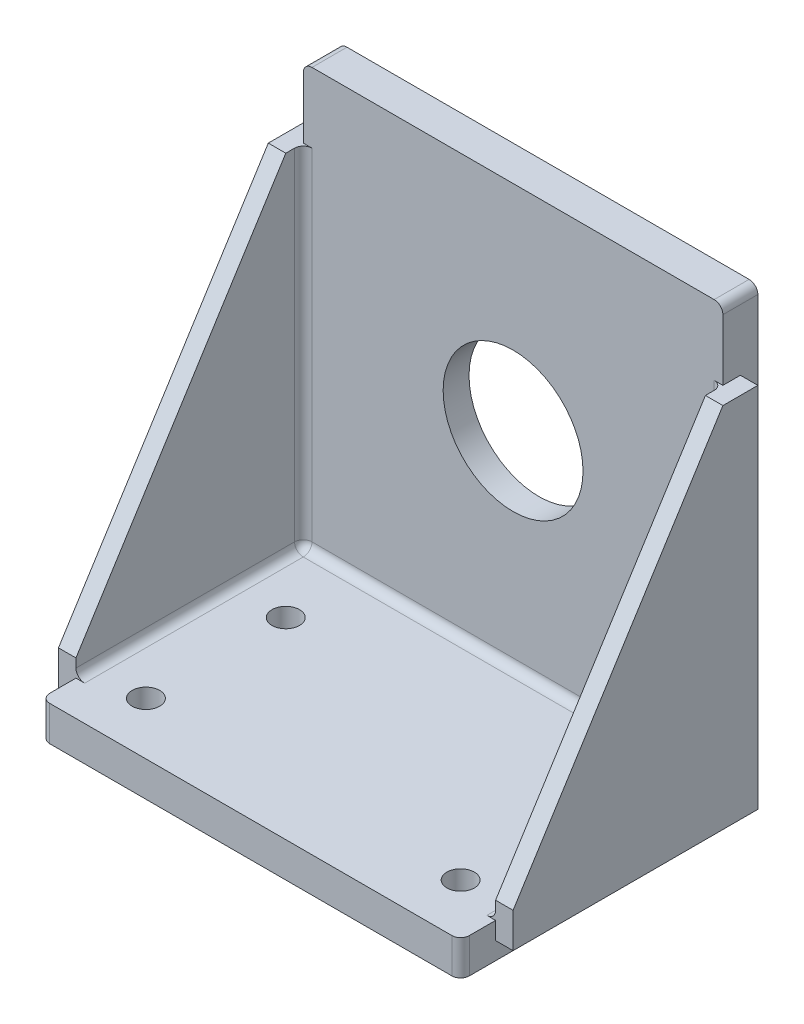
ISO-10303-21;
HEADER;
FILE_DESCRIPTION(('STEP AP214'),'2;1');
FILE_NAME('part.step','',(''),(''),'','','');
FILE_SCHEMA(('AUTOMOTIVE_DESIGN { 1 0 10303 214 1 1 1 1 }'));
ENDSEC;
DATA;
#1=APPLICATION_CONTEXT('core data for automotive mechanical design processes');
#2=APPLICATION_PROTOCOL_DEFINITION('international standard','automotive_design',2000,#1);
#3=PRODUCT_CONTEXT('',#1,'mechanical');
#4=PRODUCT('Part','Part','',(#3));
#5=PRODUCT_RELATED_PRODUCT_CATEGORY('part','',(#4));
#6=PRODUCT_DEFINITION_FORMATION('','',#4);
#7=PRODUCT_DEFINITION_CONTEXT('part definition',#1,'design');
#8=PRODUCT_DEFINITION('design','',#6,#7);
#9=PRODUCT_DEFINITION_SHAPE('','',#8);
#10=(LENGTH_UNIT() NAMED_UNIT(*) SI_UNIT(.MILLI.,.METRE.));
#11=(NAMED_UNIT(*) PLANE_ANGLE_UNIT() SI_UNIT($,.RADIAN.));
#12=(NAMED_UNIT(*) SI_UNIT($,.STERADIAN.) SOLID_ANGLE_UNIT());
#13=UNCERTAINTY_MEASURE_WITH_UNIT(LENGTH_MEASURE(1.E-05),#10,'distance_accuracy_value','');
#14=(GEOMETRIC_REPRESENTATION_CONTEXT(3) GLOBAL_UNCERTAINTY_ASSIGNED_CONTEXT((#13)) GLOBAL_UNIT_ASSIGNED_CONTEXT((#10,
#11,#12)) REPRESENTATION_CONTEXT('',''));
#15=CARTESIAN_POINT('',(0.,0.,0.));
#16=DIRECTION('',(0.,0.,1.));
#17=DIRECTION('',(1.,0.,0.));
#18=AXIS2_PLACEMENT_3D('',#15,#16,#17);
#19=CARTESIAN_POINT('',(-76.2,77.7875,12.7));
#20=DIRECTION('',(1.,0.,0.));
#21=DIRECTION('',(0.,1.,0.));
#22=AXIS2_PLACEMENT_3D('',#19,#20,#21);
#23=PLANE('',#22);
#24=DIRECTION('',(0.,0.,-1.));
#25=VECTOR('',#24,1.);
#26=CARTESIAN_POINT('',(-76.2,-87.3125,107.95));
#27=LINE('',#26,#25);
#28=CARTESIAN_POINT('',(-76.2,-87.3125,104.775));
#29=VERTEX_POINT('',#28);
#30=CARTESIAN_POINT('',(-76.2,-87.3125,6.35));
#31=VERTEX_POINT('',#30);
#32=EDGE_CURVE('E340',#29,#31,#27,.T.);
#33=ORIENTED_EDGE('',*,*,#32,.F.);
#34=DIRECTION('',(0.,1.,0.));
#35=VECTOR('',#34,1.);
#36=CARTESIAN_POINT('',(-76.2,77.7875,104.775));
#37=LINE('',#36,#35);
#38=CARTESIAN_POINT('',(-76.2,-74.6125,104.775));
#39=VERTEX_POINT('',#38);
#40=EDGE_CURVE('E467',#29,#39,#37,.T.);
#41=ORIENTED_EDGE('',*,*,#40,.T.);
#42=DIRECTION('',(0.,0.,1.));
#43=VECTOR('',#42,1.);
#44=CARTESIAN_POINT('',(-76.2,-74.6125,6.35));
#45=LINE('',#44,#43);
#46=CARTESIAN_POINT('',(-76.2,-74.6125,95.25));
#47=VERTEX_POINT('',#46);
#48=EDGE_CURVE('E343',#47,#39,#45,.T.);
#49=ORIENTED_EDGE('',*,*,#48,.F.);
#50=DIRECTION('',(0.,-1.,0.));
#51=VECTOR('',#50,1.);
#52=CARTESIAN_POINT('',(-76.2,-68.2625,95.25));
#53=LINE('',#52,#51);
#54=CARTESIAN_POINT('',(-76.2,-80.9625,95.25));
#55=VERTEX_POINT('',#54);
#56=EDGE_CURVE('E281',#47,#55,#53,.T.);
#57=ORIENTED_EDGE('',*,*,#56,.T.);
#58=DIRECTION('',(0.,0.,1.));
#59=VECTOR('',#58,1.);
#60=CARTESIAN_POINT('',(-76.2,-80.9625,6.35));
#61=LINE('',#60,#59);
#62=CARTESIAN_POINT('',(-76.2,-80.9625,6.35));
#63=VERTEX_POINT('',#62);
#64=EDGE_CURVE('E277',#63,#55,#61,.T.);
#65=ORIENTED_EDGE('',*,*,#64,.F.);
#66=DIRECTION('',(0.,-1.,0.));
#67=VECTOR('',#66,1.);
#68=CARTESIAN_POINT('',(-76.2,-74.6125,6.35));
#69=LINE('',#68,#67);
#70=EDGE_CURVE('E337',#63,#31,#69,.T.);
#71=ORIENTED_EDGE('',*,*,#70,.T.);
#72=EDGE_LOOP('',(#33,#41,#49,#57,#65,#71));
#73=FACE_BOUND('',#72,.T.);
#74=ADVANCED_FACE('F41',(#73),#23,.F.);
#75=CARTESIAN_POINT('',(76.2,-74.6125,12.7));
#76=DIRECTION('',(-1.,0.,0.));
#77=DIRECTION('',(0.,0.,1.));
#78=AXIS2_PLACEMENT_3D('',#75,#76,#77);
#79=PLANE('',#78);
#80=DIRECTION('',(0.,1.,0.));
#81=VECTOR('',#80,1.);
#82=CARTESIAN_POINT('',(76.2,-74.6125,0.));
#83=LINE('',#82,#81);
#84=CARTESIAN_POINT('',(76.2,-74.6125,0.));
#85=VERTEX_POINT('',#84);
#86=CARTESIAN_POINT('',(76.2,74.6124999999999,0.));
#87=VERTEX_POINT('',#86);
#88=EDGE_CURVE('E363',#85,#87,#83,.T.);
#89=ORIENTED_EDGE('',*,*,#88,.T.);
#90=DIRECTION('',(0.,0.,-1.));
#91=VECTOR('',#90,1.);
#92=CARTESIAN_POINT('',(76.2,74.6125,12.7));
#93=LINE('',#92,#91);
#94=CARTESIAN_POINT('',(76.2,74.6124999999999,12.7));
#95=VERTEX_POINT('',#94);
#96=EDGE_CURVE('E454',#87,#95,#93,.F.);
#97=ORIENTED_EDGE('',*,*,#96,.T.);
#98=DIRECTION('',(0.,1.,0.));
#99=VECTOR('',#98,1.);
#100=CARTESIAN_POINT('',(76.2,-74.6125,12.7));
#101=LINE('',#100,#99);
#102=CARTESIAN_POINT('',(76.2,52.3874999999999,12.7));
#103=VERTEX_POINT('',#102);
#104=EDGE_CURVE('E364',#103,#95,#101,.T.);
#105=ORIENTED_EDGE('',*,*,#104,.F.);
#106=DIRECTION('',(0.,0.,1.));
#107=VECTOR('',#106,1.);
#108=CARTESIAN_POINT('',(76.2,52.3875,6.35));
#109=LINE('',#108,#107);
#110=CARTESIAN_POINT('',(76.2,52.3875,6.35));
#111=VERTEX_POINT('',#110);
#112=EDGE_CURVE('E310',#111,#103,#109,.T.);
#113=ORIENTED_EDGE('',*,*,#112,.F.);
#114=DIRECTION('',(0.,1.,0.));
#115=VECTOR('',#114,1.);
#116=CARTESIAN_POINT('',(76.2,-80.9625,6.35));
#117=LINE('',#116,#115);
#118=CARTESIAN_POINT('',(76.2,-74.6125,6.35));
#119=VERTEX_POINT('',#118);
#120=EDGE_CURVE('E282',#119,#111,#117,.T.);
#121=ORIENTED_EDGE('',*,*,#120,.F.);
#122=DIRECTION('',(0.,0.,-1.));
#123=VECTOR('',#122,1.);
#124=CARTESIAN_POINT('',(76.2,-74.6125,12.7));
#125=LINE('',#124,#123);
#126=EDGE_CURVE('E373',#119,#85,#125,.T.);
#127=ORIENTED_EDGE('',*,*,#126,.T.);
#128=EDGE_LOOP('',(#89,#97,#105,#113,#121,#127));
#129=FACE_BOUND('',#128,.T.);
#130=ADVANCED_FACE('F541',(#129),#79,.F.);
#131=DIRECTION('',(0.,0.,1.));
#132=VECTOR('',#131,1.);
#133=CARTESIAN_POINT('',(76.2,-74.6125,6.35));
#134=LINE('',#133,#132);
#135=CARTESIAN_POINT('',(76.2,-74.6125,95.25));
#136=VERTEX_POINT('',#135);
#137=CARTESIAN_POINT('',(76.2,-74.6125,104.775));
#138=VERTEX_POINT('',#137);
#139=EDGE_CURVE('E341',#136,#138,#134,.T.);
#140=ORIENTED_EDGE('',*,*,#139,.T.);
#141=DIRECTION('',(0.,1.,0.));
#142=VECTOR('',#141,1.);
#143=CARTESIAN_POINT('',(76.2,-74.6125,104.775));
#144=LINE('',#143,#142);
#145=CARTESIAN_POINT('',(76.2,-87.3125,104.775));
#146=VERTEX_POINT('',#145);
#147=EDGE_CURVE('E461',#138,#146,#144,.F.);
#148=ORIENTED_EDGE('',*,*,#147,.T.);
#149=DIRECTION('',(0.,0.,-1.));
#150=VECTOR('',#149,1.);
#151=CARTESIAN_POINT('',(76.2,-87.3125,107.95));
#152=LINE('',#151,#150);
#153=CARTESIAN_POINT('',(76.2,-87.3125,6.35));
#154=VERTEX_POINT('',#153);
#155=EDGE_CURVE('E349',#146,#154,#152,.T.);
#156=ORIENTED_EDGE('',*,*,#155,.T.);
#157=DIRECTION('',(0.,-1.,0.));
#158=VECTOR('',#157,1.);
#159=CARTESIAN_POINT('',(76.2,-74.6125,6.35));
#160=LINE('',#159,#158);
#161=CARTESIAN_POINT('',(76.2,-80.9625,6.35));
#162=VERTEX_POINT('',#161);
#163=EDGE_CURVE('E336',#162,#154,#160,.T.);
#164=ORIENTED_EDGE('',*,*,#163,.F.);
#165=DIRECTION('',(0.,0.,1.));
#166=VECTOR('',#165,1.);
#167=CARTESIAN_POINT('',(76.2,-80.9625,6.35));
#168=LINE('',#167,#166);
#169=CARTESIAN_POINT('',(76.2,-80.9625,95.25));
#170=VERTEX_POINT('',#169);
#171=EDGE_CURVE('E300',#162,#170,#168,.T.);
#172=ORIENTED_EDGE('',*,*,#171,.T.);
#173=DIRECTION('',(0.,-1.,0.));
#174=VECTOR('',#173,1.);
#175=CARTESIAN_POINT('',(76.2,-68.2625,95.25));
#176=LINE('',#175,#174);
#177=EDGE_CURVE('E318',#136,#170,#176,.T.);
#178=ORIENTED_EDGE('',*,*,#177,.F.);
#179=EDGE_LOOP('',(#140,#148,#156,#164,#172,#178));
#180=FACE_BOUND('',#179,.T.);
#181=ADVANCED_FACE('F586',(#180),#79,.F.);
#182=CARTESIAN_POINT('',(76.2,77.7875,12.7));
#183=DIRECTION('',(0.,-1.,0.));
#184=DIRECTION('',(1.,0.,0.));
#185=AXIS2_PLACEMENT_3D('',#182,#183,#184);
#186=PLANE('',#185);
#187=DIRECTION('',(-1.,0.,0.));
#188=VECTOR('',#187,1.);
#189=CARTESIAN_POINT('',(76.2,77.7875,0.));
#190=LINE('',#189,#188);
#191=CARTESIAN_POINT('',(73.025,77.7875,0.));
#192=VERTEX_POINT('',#191);
#193=CARTESIAN_POINT('',(-73.0249999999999,77.7875,0.));
#194=VERTEX_POINT('',#193);
#195=EDGE_CURVE('E376',#192,#194,#190,.T.);
#196=ORIENTED_EDGE('',*,*,#195,.T.);
#197=DIRECTION('',(0.,0.,-1.));
#198=VECTOR('',#197,1.);
#199=CARTESIAN_POINT('',(-73.025,77.7875,12.7));
#200=LINE('',#199,#198);
#201=CARTESIAN_POINT('',(-73.0249999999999,77.7875,12.7));
#202=VERTEX_POINT('',#201);
#203=EDGE_CURVE('E440',#194,#202,#200,.F.);
#204=ORIENTED_EDGE('',*,*,#203,.T.);
#205=DIRECTION('',(-1.,0.,0.));
#206=VECTOR('',#205,1.);
#207=CARTESIAN_POINT('',(76.2,77.7875,12.7));
#208=LINE('',#207,#206);
#209=CARTESIAN_POINT('',(73.025,77.7875,12.7));
#210=VERTEX_POINT('',#209);
#211=EDGE_CURVE('E367',#210,#202,#208,.T.);
#212=ORIENTED_EDGE('',*,*,#211,.F.);
#213=DIRECTION('',(0.,0.,-1.));
#214=VECTOR('',#213,1.);
#215=CARTESIAN_POINT('',(73.025,77.7875,12.7));
#216=LINE('',#215,#214);
#217=EDGE_CURVE('E437',#210,#192,#216,.T.);
#218=ORIENTED_EDGE('',*,*,#217,.T.);
#219=EDGE_LOOP('',(#196,#204,#212,#218));
#220=FACE_BOUND('',#219,.T.);
#221=ADVANCED_FACE('F566',(#220),#186,.F.);
#222=DIRECTION('',(0.,-1.,0.));
#223=VECTOR('',#222,1.);
#224=CARTESIAN_POINT('',(-76.2,77.7875,12.7));
#225=LINE('',#224,#223);
#226=CARTESIAN_POINT('',(-76.2,74.6125,12.7));
#227=VERTEX_POINT('',#226);
#228=CARTESIAN_POINT('',(-76.2,52.3875,12.7));
#229=VERTEX_POINT('',#228);
#230=EDGE_CURVE('E371',#227,#229,#225,.T.);
#231=ORIENTED_EDGE('',*,*,#230,.F.);
#232=DIRECTION('',(0.,0.,-1.));
#233=VECTOR('',#232,1.);
#234=CARTESIAN_POINT('',(-76.2,74.6125,12.7));
#235=LINE('',#234,#233);
#236=CARTESIAN_POINT('',(-76.2,74.6125,0.));
#237=VERTEX_POINT('',#236);
#238=EDGE_CURVE('E430',#227,#237,#235,.T.);
#239=ORIENTED_EDGE('',*,*,#238,.T.);
#240=DIRECTION('',(0.,-1.,0.));
#241=VECTOR('',#240,1.);
#242=CARTESIAN_POINT('',(-76.2,77.7875,0.));
#243=LINE('',#242,#241);
#244=CARTESIAN_POINT('',(-76.2,-74.6125,0.));
#245=VERTEX_POINT('',#244);
#246=EDGE_CURVE('E379',#237,#245,#243,.T.);
#247=ORIENTED_EDGE('',*,*,#246,.T.);
#248=DIRECTION('',(0.,0.,-1.));
#249=VECTOR('',#248,1.);
#250=CARTESIAN_POINT('',(-76.2,-74.6125,12.7));
#251=LINE('',#250,#249);
#252=CARTESIAN_POINT('',(-76.2,-74.6125,6.35));
#253=VERTEX_POINT('',#252);
#254=EDGE_CURVE('E384',#253,#245,#251,.T.);
#255=ORIENTED_EDGE('',*,*,#254,.F.);
#256=DIRECTION('',(0.,1.,0.));
#257=VECTOR('',#256,1.);
#258=CARTESIAN_POINT('',(-76.2,-80.9625,6.35));
#259=LINE('',#258,#257);
#260=CARTESIAN_POINT('',(-76.2,52.3875,6.35));
#261=VERTEX_POINT('',#260);
#262=EDGE_CURVE('E279',#253,#261,#259,.T.);
#263=ORIENTED_EDGE('',*,*,#262,.T.);
#264=DIRECTION('',(0.,0.,1.));
#265=VECTOR('',#264,1.);
#266=CARTESIAN_POINT('',(-76.2,52.3875,6.35));
#267=LINE('',#266,#265);
#268=EDGE_CURVE('E246',#261,#229,#267,.T.);
#269=ORIENTED_EDGE('',*,*,#268,.T.);
#270=EDGE_LOOP('',(#231,#239,#247,#255,#263,#269));
#271=FACE_BOUND('',#270,.T.);
#272=ADVANCED_FACE('F551',(#271),#23,.F.);
#273=CARTESIAN_POINT('',(76.2,-74.6125,12.7));
#274=DIRECTION('',(0.,-1.,0.));
#275=DIRECTION('',(1.,0.,0.));
#276=AXIS2_PLACEMENT_3D('',#273,#274,#275);
#277=PLANE('',#276);
#278=DIRECTION('',(1.,0.,0.));
#279=VECTOR('',#278,1.);
#280=CARTESIAN_POINT('',(-76.2,-74.6125,6.35));
#281=LINE('',#280,#279);
#282=EDGE_CURVE('E346',#253,#119,#281,.T.);
#283=ORIENTED_EDGE('',*,*,#282,.F.);
#284=ORIENTED_EDGE('',*,*,#254,.T.);
#285=DIRECTION('',(-1.,0.,0.));
#286=VECTOR('',#285,1.);
#287=CARTESIAN_POINT('',(76.2,-74.6125,0.));
#288=LINE('',#287,#286);
#289=EDGE_CURVE('E368',#85,#245,#288,.T.);
#290=ORIENTED_EDGE('',*,*,#289,.F.);
#291=ORIENTED_EDGE('',*,*,#126,.F.);
#292=EDGE_LOOP('',(#283,#284,#290,#291));
#293=FACE_BOUND('',#292,.T.);
#294=ADVANCED_FACE('F547',(#293),#277,.T.);
#295=CARTESIAN_POINT('',(76.2,-74.6125,12.7));
#296=DIRECTION('',(0.,0.,1.));
#297=DIRECTION('',(1.,0.,0.));
#298=AXIS2_PLACEMENT_3D('',#295,#296,#297);
#299=PLANE('',#298);
#300=CARTESIAN_POINT('',(0.,0.,12.7));
#301=DIRECTION('',(0.,0.,1.));
#302=DIRECTION('',(1.,0.,0.));
#303=AXIS2_PLACEMENT_3D('',#300,#301,#302);
#304=CIRCLE('',#303,25.4);
#305=CARTESIAN_POINT('',(25.4,0.,12.7));
#306=VERTEX_POINT('',#305);
#307=EDGE_CURVE('E1098',#306,#306,#304,.T.);
#308=ORIENTED_EDGE('',*,*,#307,.F.);
#309=EDGE_LOOP('',(#308));
#310=FACE_BOUND('',#309,.T.);
#311=ORIENTED_EDGE('',*,*,#211,.T.);
#312=CARTESIAN_POINT('',(-73.025,74.6125,12.7));
#313=DIRECTION('',(0.,0.,1.));
#314=DIRECTION('',(1.,0.,0.));
#315=AXIS2_PLACEMENT_3D('',#312,#313,#314);
#316=CIRCLE('',#315,3.175);
#317=EDGE_CURVE('E452',#202,#227,#316,.T.);
#318=ORIENTED_EDGE('',*,*,#317,.T.);
#319=ORIENTED_EDGE('',*,*,#230,.T.);
#320=DIRECTION('',(1.,0.,0.));
#321=VECTOR('',#320,1.);
#322=CARTESIAN_POINT('',(-82.55,52.3875,12.7));
#323=LINE('',#322,#321);
#324=CARTESIAN_POINT('',(-73.025,52.3875,12.7));
#325=VERTEX_POINT('',#324);
#326=EDGE_CURVE('E58',#229,#325,#323,.T.);
#327=ORIENTED_EDGE('',*,*,#326,.T.);
#328=DIRECTION('',(0.,-1.,0.));
#329=VECTOR('',#328,1.);
#330=CARTESIAN_POINT('',(-73.025,-74.6125,12.7));
#331=LINE('',#330,#329);
#332=CARTESIAN_POINT('',(-73.025,-71.4375,12.7));
#333=VERTEX_POINT('',#332);
#334=EDGE_CURVE('E448',#325,#333,#331,.T.);
#335=ORIENTED_EDGE('',*,*,#334,.T.);
#336=DIRECTION('',(-1.,0.,0.));
#337=VECTOR('',#336,1.);
#338=CARTESIAN_POINT('',(76.2,-71.4375,12.7));
#339=LINE('',#338,#337);
#340=CARTESIAN_POINT('',(73.025,-71.4375,12.7));
#341=VERTEX_POINT('',#340);
#342=EDGE_CURVE('E402',#333,#341,#339,.F.);
#343=ORIENTED_EDGE('',*,*,#342,.T.);
#344=DIRECTION('',(0.,1.,0.));
#345=VECTOR('',#344,1.);
#346=CARTESIAN_POINT('',(73.025,-74.6125,12.7));
#347=LINE('',#346,#345);
#348=CARTESIAN_POINT('',(73.025,52.3875,12.7));
#349=VERTEX_POINT('',#348);
#350=EDGE_CURVE('E444',#341,#349,#347,.T.);
#351=ORIENTED_EDGE('',*,*,#350,.T.);
#352=DIRECTION('',(1.,0.,0.));
#353=VECTOR('',#352,1.);
#354=CARTESIAN_POINT('',(76.2,52.3875,12.7));
#355=LINE('',#354,#353);
#356=EDGE_CURVE('E442',#349,#103,#355,.T.);
#357=ORIENTED_EDGE('',*,*,#356,.T.);
#358=ORIENTED_EDGE('',*,*,#104,.T.);
#359=CARTESIAN_POINT('',(73.025,74.6125,12.7));
#360=DIRECTION('',(0.,0.,1.));
#361=DIRECTION('',(1.,0.,0.));
#362=AXIS2_PLACEMENT_3D('',#359,#360,#361);
#363=CIRCLE('',#362,3.175);
#364=EDGE_CURVE('E450',#95,#210,#363,.T.);
#365=ORIENTED_EDGE('',*,*,#364,.T.);
#366=EDGE_LOOP('',(#311,#318,#319,#327,#335,#343,#351,#357,#358,#365));
#367=FACE_BOUND('',#366,.T.);
#368=ADVANCED_FACE('F498',(#310,#367),#299,.T.);
#369=CARTESIAN_POINT('',(76.2,-74.6125,0.));
#370=DIRECTION('',(0.,0.,1.));
#371=DIRECTION('',(1.,0.,0.));
#372=AXIS2_PLACEMENT_3D('',#369,#370,#371);
#373=PLANE('',#372);
#374=CARTESIAN_POINT('',(0.,0.,0.));
#375=DIRECTION('',(0.,0.,-1.));
#376=DIRECTION('',(-1.,0.,0.));
#377=AXIS2_PLACEMENT_3D('',#374,#375,#376);
#378=CIRCLE('',#377,63.5635);
#379=CARTESIAN_POINT('',(-63.5635,0.,0.));
#380=VERTEX_POINT('',#379);
#381=EDGE_CURVE('E1099',#380,#380,#378,.T.);
#382=ORIENTED_EDGE('',*,*,#381,.F.);
#383=EDGE_LOOP('',(#382));
#384=FACE_BOUND('',#383,.T.);
#385=ORIENTED_EDGE('',*,*,#246,.F.);
#386=CARTESIAN_POINT('',(-73.025,74.6125,0.));
#387=DIRECTION('',(0.,0.,1.));
#388=DIRECTION('',(1.,0.,0.));
#389=AXIS2_PLACEMENT_3D('',#386,#387,#388);
#390=CIRCLE('',#389,3.175);
#391=EDGE_CURVE('E435',#237,#194,#390,.F.);
#392=ORIENTED_EDGE('',*,*,#391,.T.);
#393=ORIENTED_EDGE('',*,*,#195,.F.);
#394=CARTESIAN_POINT('',(73.025,74.6125,0.));
#395=DIRECTION('',(0.,0.,1.));
#396=DIRECTION('',(1.,0.,0.));
#397=AXIS2_PLACEMENT_3D('',#394,#395,#396);
#398=CIRCLE('',#397,3.175);
#399=EDGE_CURVE('E433',#192,#87,#398,.F.);
#400=ORIENTED_EDGE('',*,*,#399,.T.);
#401=ORIENTED_EDGE('',*,*,#88,.F.);
#402=ORIENTED_EDGE('',*,*,#289,.T.);
#403=EDGE_LOOP('',(#385,#392,#393,#400,#401,#402));
#404=FACE_BOUND('',#403,.T.);
#405=ADVANCED_FACE('F555',(#384,#404),#373,.F.);
#406=CARTESIAN_POINT('',(-76.2,-74.6125,6.35));
#407=DIRECTION('',(0.,0.,1.));
#408=DIRECTION('',(0.,-1.,0.));
#409=AXIS2_PLACEMENT_3D('',#406,#407,#408);
#410=PLANE('',#409);
#411=ORIENTED_EDGE('',*,*,#282,.T.);
#412=ORIENTED_EDGE('',*,*,#120,.T.);
#413=DIRECTION('',(-1.,0.,0.));
#414=VECTOR('',#413,1.);
#415=CARTESIAN_POINT('',(82.55,52.3875,6.35));
#416=LINE('',#415,#414);
#417=CARTESIAN_POINT('',(82.55,52.3875,6.35));
#418=VERTEX_POINT('',#417);
#419=EDGE_CURVE('E309',#418,#111,#416,.T.);
#420=ORIENTED_EDGE('',*,*,#419,.F.);
#421=DIRECTION('',(0.,1.,0.));
#422=VECTOR('',#421,1.);
#423=CARTESIAN_POINT('',(82.55,-80.9625,6.35));
#424=LINE('',#423,#422);
#425=CARTESIAN_POINT('',(82.55,-80.9625,6.35));
#426=VERTEX_POINT('',#425);
#427=EDGE_CURVE('E307',#426,#418,#424,.T.);
#428=ORIENTED_EDGE('',*,*,#427,.F.);
#429=DIRECTION('',(-1.,0.,0.));
#430=VECTOR('',#429,1.);
#431=CARTESIAN_POINT('',(82.55,-80.9625,6.35));
#432=LINE('',#431,#430);
#433=EDGE_CURVE('E324',#426,#162,#432,.T.);
#434=ORIENTED_EDGE('',*,*,#433,.T.);
#435=ORIENTED_EDGE('',*,*,#163,.T.);
#436=DIRECTION('',(1.,0.,0.));
#437=VECTOR('',#436,1.);
#438=CARTESIAN_POINT('',(-76.2,-87.3125,6.35));
#439=LINE('',#438,#437);
#440=EDGE_CURVE('E360',#31,#154,#439,.T.);
#441=ORIENTED_EDGE('',*,*,#440,.F.);
#442=ORIENTED_EDGE('',*,*,#70,.F.);
#443=DIRECTION('',(1.,0.,0.));
#444=VECTOR('',#443,1.);
#445=CARTESIAN_POINT('',(-82.55,-80.9625,6.35));
#446=LINE('',#445,#444);
#447=CARTESIAN_POINT('',(-82.55,-80.9625,6.35));
#448=VERTEX_POINT('',#447);
#449=EDGE_CURVE('E251',#448,#63,#446,.T.);
#450=ORIENTED_EDGE('',*,*,#449,.F.);
#451=DIRECTION('',(0.,1.,0.));
#452=VECTOR('',#451,1.);
#453=CARTESIAN_POINT('',(-82.55,-80.9625,6.35));
#454=LINE('',#453,#452);
#455=CARTESIAN_POINT('',(-82.55,52.3875,6.35));
#456=VERTEX_POINT('',#455);
#457=EDGE_CURVE('E256',#448,#456,#454,.T.);
#458=ORIENTED_EDGE('',*,*,#457,.T.);
#459=DIRECTION('',(1.,0.,0.));
#460=VECTOR('',#459,1.);
#461=CARTESIAN_POINT('',(-82.55,52.3875,6.35));
#462=LINE('',#461,#460);
#463=EDGE_CURVE('E239',#456,#261,#462,.T.);
#464=ORIENTED_EDGE('',*,*,#463,.T.);
#465=ORIENTED_EDGE('',*,*,#262,.F.);
#466=EDGE_LOOP('',(#411,#412,#420,#428,#434,#435,#441,#442,#450,#458,#464,#465));
#467=FACE_BOUND('',#466,.T.);
#468=ADVANCED_FACE('F263',(#467),#410,.F.);
#469=CARTESIAN_POINT('',(-76.2,-87.3125,107.95));
#470=DIRECTION('',(0.,-1.,0.));
#471=DIRECTION('',(0.,0.,-1.));
#472=AXIS2_PLACEMENT_3D('',#469,#470,#471);
#473=PLANE('',#472);
#474=CARTESIAN_POINT('',(57.15,-87.3125,88.9));
#475=DIRECTION('',(0.,1.,0.));
#476=DIRECTION('',(0.,0.,1.));
#477=AXIS2_PLACEMENT_3D('',#474,#475,#476);
#478=CIRCLE('',#477,5.00000000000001);
#479=CARTESIAN_POINT('',(57.15,-87.3125,93.9));
#480=VERTEX_POINT('',#479);
#481=EDGE_CURVE('E1108',#480,#480,#478,.T.);
#482=ORIENTED_EDGE('',*,*,#481,.T.);
#483=EDGE_LOOP('',(#482));
#484=FACE_BOUND('',#483,.T.);
#485=CARTESIAN_POINT('',(-57.15,-87.3125,88.9));
#486=DIRECTION('',(0.,1.,0.));
#487=DIRECTION('',(0.,0.,1.));
#488=AXIS2_PLACEMENT_3D('',#485,#486,#487);
#489=CIRCLE('',#488,5.00000000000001);
#490=CARTESIAN_POINT('',(-57.15,-87.3125,93.9));
#491=VERTEX_POINT('',#490);
#492=EDGE_CURVE('E1117',#491,#491,#489,.T.);
#493=ORIENTED_EDGE('',*,*,#492,.T.);
#494=EDGE_LOOP('',(#493));
#495=FACE_BOUND('',#494,.T.);
#496=ORIENTED_EDGE('',*,*,#155,.F.);
#497=CARTESIAN_POINT('',(73.025,-87.3125,104.775));
#498=DIRECTION('',(0.,-1.,0.));
#499=DIRECTION('',(0.,0.,-1.));
#500=AXIS2_PLACEMENT_3D('',#497,#498,#499);
#501=CIRCLE('',#500,3.175);
#502=CARTESIAN_POINT('',(73.025,-87.3125,107.95));
#503=VERTEX_POINT('',#502);
#504=EDGE_CURVE('E465',#146,#503,#501,.T.);
#505=ORIENTED_EDGE('',*,*,#504,.T.);
#506=DIRECTION('',(1.,0.,0.));
#507=VECTOR('',#506,1.);
#508=CARTESIAN_POINT('',(-76.2,-87.3125,107.95));
#509=LINE('',#508,#507);
#510=CARTESIAN_POINT('',(-73.025,-87.3125,107.95));
#511=VERTEX_POINT('',#510);
#512=EDGE_CURVE('E357',#511,#503,#509,.T.);
#513=ORIENTED_EDGE('',*,*,#512,.F.);
#514=CARTESIAN_POINT('',(-73.025,-87.3125,104.775));
#515=DIRECTION('',(0.,-1.,0.));
#516=DIRECTION('',(0.,0.,-1.));
#517=AXIS2_PLACEMENT_3D('',#514,#515,#516);
#518=CIRCLE('',#517,3.175);
#519=EDGE_CURVE('E463',#511,#29,#518,.T.);
#520=ORIENTED_EDGE('',*,*,#519,.T.);
#521=ORIENTED_EDGE('',*,*,#32,.T.);
#522=ORIENTED_EDGE('',*,*,#440,.T.);
#523=EDGE_LOOP('',(#496,#505,#513,#520,#521,#522));
#524=FACE_BOUND('',#523,.T.);
#525=CARTESIAN_POINT('',(-57.1499999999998,-87.3125,38.1));
#526=DIRECTION('',(0.,1.,0.));
#527=DIRECTION('',(0.,0.,1.));
#528=AXIS2_PLACEMENT_3D('',#525,#526,#527);
#529=CIRCLE('',#528,5.00000000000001);
#530=CARTESIAN_POINT('',(-57.1499999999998,-87.3125,43.1));
#531=VERTEX_POINT('',#530);
#532=EDGE_CURVE('E387',#531,#531,#529,.T.);
#533=ORIENTED_EDGE('',*,*,#532,.T.);
#534=EDGE_LOOP('',(#533));
#535=FACE_BOUND('',#534,.T.);
#536=CARTESIAN_POINT('',(57.1500000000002,-87.3125,38.1));
#537=DIRECTION('',(0.,1.,0.));
#538=DIRECTION('',(0.,0.,1.));
#539=AXIS2_PLACEMENT_3D('',#536,#537,#538);
#540=CIRCLE('',#539,5.00000000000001);
#541=CARTESIAN_POINT('',(57.1500000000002,-87.3125,43.1));
#542=VERTEX_POINT('',#541);
#543=EDGE_CURVE('E393',#542,#542,#540,.T.);
#544=ORIENTED_EDGE('',*,*,#543,.T.);
#545=EDGE_LOOP('',(#544));
#546=FACE_BOUND('',#545,.T.);
#547=ADVANCED_FACE('F909',(#484,#495,#524,#535,#546),#473,.T.);
#548=CARTESIAN_POINT('',(-76.2,-87.3125,107.95));
#549=DIRECTION('',(0.,0.,-1.));
#550=DIRECTION('',(-1.,0.,0.));
#551=AXIS2_PLACEMENT_3D('',#548,#549,#550);
#552=PLANE('',#551);
#553=ORIENTED_EDGE('',*,*,#512,.T.);
#554=DIRECTION('',(0.,1.,0.));
#555=VECTOR('',#554,1.);
#556=CARTESIAN_POINT('',(73.025,-87.3125,107.95));
#557=LINE('',#556,#555);
#558=CARTESIAN_POINT('',(73.025,-74.6125,107.95));
#559=VERTEX_POINT('',#558);
#560=EDGE_CURVE('E458',#503,#559,#557,.T.);
#561=ORIENTED_EDGE('',*,*,#560,.T.);
#562=DIRECTION('',(1.,0.,0.));
#563=VECTOR('',#562,1.);
#564=CARTESIAN_POINT('',(-76.2,-74.6125,107.95));
#565=LINE('',#564,#563);
#566=CARTESIAN_POINT('',(-73.025,-74.6125,107.95));
#567=VERTEX_POINT('',#566);
#568=EDGE_CURVE('E354',#567,#559,#565,.T.);
#569=ORIENTED_EDGE('',*,*,#568,.F.);
#570=DIRECTION('',(0.,1.,0.));
#571=VECTOR('',#570,1.);
#572=CARTESIAN_POINT('',(-73.025,-87.3125,107.95));
#573=LINE('',#572,#571);
#574=EDGE_CURVE('E456',#567,#511,#573,.F.);
#575=ORIENTED_EDGE('',*,*,#574,.T.);
#576=EDGE_LOOP('',(#553,#561,#569,#575));
#577=FACE_BOUND('',#576,.T.);
#578=ADVANCED_FACE('F899',(#577),#552,.F.);
#579=CARTESIAN_POINT('',(-76.2,-74.6125,6.35));
#580=DIRECTION('',(0.,1.,0.));
#581=DIRECTION('',(0.,0.,1.));
#582=AXIS2_PLACEMENT_3D('',#579,#580,#581);
#583=PLANE('',#582);
#584=CARTESIAN_POINT('',(57.15,-74.6125,88.9));
#585=DIRECTION('',(0.,1.,0.));
#586=DIRECTION('',(0.,0.,1.));
#587=AXIS2_PLACEMENT_3D('',#584,#585,#586);
#588=CIRCLE('',#587,5.00000000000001);
#589=CARTESIAN_POINT('',(57.15,-74.6125,93.9));
#590=VERTEX_POINT('',#589);
#591=EDGE_CURVE('E1112',#590,#590,#588,.T.);
#592=ORIENTED_EDGE('',*,*,#591,.F.);
#593=EDGE_LOOP('',(#592));
#594=FACE_BOUND('',#593,.T.);
#595=CARTESIAN_POINT('',(-57.15,-74.6125,88.9));
#596=DIRECTION('',(0.,1.,0.));
#597=DIRECTION('',(0.,0.,1.));
#598=AXIS2_PLACEMENT_3D('',#595,#596,#597);
#599=CIRCLE('',#598,5.00000000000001);
#600=CARTESIAN_POINT('',(-57.15,-74.6125,93.9));
#601=VERTEX_POINT('',#600);
#602=EDGE_CURVE('E1115',#601,#601,#599,.T.);
#603=ORIENTED_EDGE('',*,*,#602,.F.);
#604=EDGE_LOOP('',(#603));
#605=FACE_BOUND('',#604,.T.);
#606=DIRECTION('',(-1.,0.,0.));
#607=VECTOR('',#606,1.);
#608=CARTESIAN_POINT('',(-76.2,-74.6125,15.875));
#609=LINE('',#608,#607);
#610=CARTESIAN_POINT('',(73.025,-74.6125,15.875));
#611=VERTEX_POINT('',#610);
#612=CARTESIAN_POINT('',(-73.025,-74.6125,15.875));
#613=VERTEX_POINT('',#612);
#614=EDGE_CURVE('E399',#611,#613,#609,.T.);
#615=ORIENTED_EDGE('',*,*,#614,.T.);
#616=DIRECTION('',(0.,0.,1.));
#617=VECTOR('',#616,1.);
#618=CARTESIAN_POINT('',(-73.025,-74.6125,6.35));
#619=LINE('',#618,#617);
#620=CARTESIAN_POINT('',(-73.025,-74.6125,95.25));
#621=VERTEX_POINT('',#620);
#622=EDGE_CURVE('E414',#613,#621,#619,.T.);
#623=ORIENTED_EDGE('',*,*,#622,.T.);
#624=DIRECTION('',(-1.,0.,0.));
#625=VECTOR('',#624,1.);
#626=CARTESIAN_POINT('',(-82.55,-74.6125,95.25));
#627=LINE('',#626,#625);
#628=EDGE_CURVE('E412',#621,#47,#627,.T.);
#629=ORIENTED_EDGE('',*,*,#628,.T.);
#630=ORIENTED_EDGE('',*,*,#48,.T.);
#631=CARTESIAN_POINT('',(-73.025,-74.6125,104.775));
#632=DIRECTION('',(0.,1.,0.));
#633=DIRECTION('',(0.,0.,1.));
#634=AXIS2_PLACEMENT_3D('',#631,#632,#633);
#635=CIRCLE('',#634,3.175);
#636=EDGE_CURVE('E405',#39,#567,#635,.T.);
#637=ORIENTED_EDGE('',*,*,#636,.T.);
#638=ORIENTED_EDGE('',*,*,#568,.T.);
#639=CARTESIAN_POINT('',(73.025,-74.6125,104.775));
#640=DIRECTION('',(0.,1.,0.));
#641=DIRECTION('',(0.,0.,1.));
#642=AXIS2_PLACEMENT_3D('',#639,#640,#641);
#643=CIRCLE('',#642,3.175);
#644=EDGE_CURVE('E407',#559,#138,#643,.T.);
#645=ORIENTED_EDGE('',*,*,#644,.T.);
#646=ORIENTED_EDGE('',*,*,#139,.F.);
#647=DIRECTION('',(-1.,0.,0.));
#648=VECTOR('',#647,1.);
#649=CARTESIAN_POINT('',(-76.2,-74.6125,95.25));
#650=LINE('',#649,#648);
#651=CARTESIAN_POINT('',(73.025,-74.6125,95.25));
#652=VERTEX_POINT('',#651);
#653=EDGE_CURVE('E66',#136,#652,#650,.T.);
#654=ORIENTED_EDGE('',*,*,#653,.T.);
#655=DIRECTION('',(0.,0.,1.));
#656=VECTOR('',#655,1.);
#657=CARTESIAN_POINT('',(73.025,-74.6125,6.35));
#658=LINE('',#657,#656);
#659=EDGE_CURVE('E409',#652,#611,#658,.F.);
#660=ORIENTED_EDGE('',*,*,#659,.T.);
#661=EDGE_LOOP('',(#615,#623,#629,#630,#637,#638,#645,#646,#654,#660));
#662=FACE_BOUND('',#661,.T.);
#663=CARTESIAN_POINT('',(-57.1499999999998,-74.6124999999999,38.1));
#664=DIRECTION('',(0.,1.,0.));
#665=DIRECTION('',(0.,0.,1.));
#666=AXIS2_PLACEMENT_3D('',#663,#664,#665);
#667=CIRCLE('',#666,5.00000000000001);
#668=CARTESIAN_POINT('',(-57.1499999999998,-74.6124999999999,43.1));
#669=VERTEX_POINT('',#668);
#670=EDGE_CURVE('E390',#669,#669,#667,.T.);
#671=ORIENTED_EDGE('',*,*,#670,.F.);
#672=EDGE_LOOP('',(#671));
#673=FACE_BOUND('',#672,.T.);
#674=CARTESIAN_POINT('',(57.1500000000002,-74.6124999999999,38.1));
#675=DIRECTION('',(0.,1.,0.));
#676=DIRECTION('',(0.,0.,1.));
#677=AXIS2_PLACEMENT_3D('',#674,#675,#676);
#678=CIRCLE('',#677,5.00000000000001);
#679=CARTESIAN_POINT('',(57.1500000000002,-74.6124999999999,43.1));
#680=VERTEX_POINT('',#679);
#681=EDGE_CURVE('E396',#680,#680,#678,.T.);
#682=ORIENTED_EDGE('',*,*,#681,.F.);
#683=EDGE_LOOP('',(#682));
#684=FACE_BOUND('',#683,.T.);
#685=ADVANCED_FACE('F520',(#594,#605,#662,#673,#684),#583,.T.);
#686=CARTESIAN_POINT('',(82.55,52.3875,6.35));
#687=DIRECTION('',(0.,-1.,0.));
#688=DIRECTION('',(0.,0.,-1.));
#689=AXIS2_PLACEMENT_3D('',#686,#687,#688);
#690=PLANE('',#689);
#691=ORIENTED_EDGE('',*,*,#112,.T.);
#692=ORIENTED_EDGE('',*,*,#356,.F.);
#693=CARTESIAN_POINT('',(73.025,52.3875,15.875));
#694=DIRECTION('',(0.,-1.,0.));
#695=DIRECTION('',(0.,0.,-1.));
#696=AXIS2_PLACEMENT_3D('',#693,#694,#695);
#697=CIRCLE('',#696,3.175);
#698=CARTESIAN_POINT('',(76.2,52.3875,15.875));
#699=VERTEX_POINT('',#698);
#700=EDGE_CURVE('E11',#349,#699,#697,.T.);
#701=ORIENTED_EDGE('',*,*,#700,.T.);
#702=CARTESIAN_POINT('',(76.2,52.3875,19.05));
#703=VERTEX_POINT('',#702);
#704=EDGE_CURVE('E250',#699,#703,#109,.T.);
#705=ORIENTED_EDGE('',*,*,#704,.T.);
#706=DIRECTION('',(-1.,0.,0.));
#707=VECTOR('',#706,1.);
#708=CARTESIAN_POINT('',(82.55,52.3875,19.05));
#709=LINE('',#708,#707);
#710=CARTESIAN_POINT('',(82.55,52.3875,19.05));
#711=VERTEX_POINT('',#710);
#712=EDGE_CURVE('E333',#711,#703,#709,.T.);
#713=ORIENTED_EDGE('',*,*,#712,.F.);
#714=DIRECTION('',(0.,0.,1.));
#715=VECTOR('',#714,1.);
#716=CARTESIAN_POINT('',(82.55,52.3875,6.35));
#717=LINE('',#716,#715);
#718=EDGE_CURVE('E296',#418,#711,#717,.T.);
#719=ORIENTED_EDGE('',*,*,#718,.F.);
#720=ORIENTED_EDGE('',*,*,#419,.T.);
#721=EDGE_LOOP('',(#691,#692,#701,#705,#713,#719,#720));
#722=FACE_BOUND('',#721,.T.);
#723=ADVANCED_FACE('F537',(#722),#690,.F.);
#724=CARTESIAN_POINT('',(82.55,52.3875,19.05));
#725=DIRECTION('',(0.,-0.533992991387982,-0.845488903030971));
#726=DIRECTION('',(0.,0.845488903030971,-0.533992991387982));
#727=AXIS2_PLACEMENT_3D('',#724,#725,#726);
#728=PLANE('',#727);
#729=DIRECTION('',(0.,-0.845488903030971,0.533992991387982));
#730=VECTOR('',#729,1.);
#731=CARTESIAN_POINT('',(76.2,52.3875,19.05));
#732=LINE('',#731,#730);
#733=CARTESIAN_POINT('',(76.2,-68.2625,95.25));
#734=VERTEX_POINT('',#733);
#735=EDGE_CURVE('E313',#703,#734,#732,.T.);
#736=ORIENTED_EDGE('',*,*,#735,.T.);
#737=DIRECTION('',(-1.,0.,0.));
#738=VECTOR('',#737,1.);
#739=CARTESIAN_POINT('',(82.55,-68.2625,95.25));
#740=LINE('',#739,#738);
#741=CARTESIAN_POINT('',(82.55,-68.2625,95.25));
#742=VERTEX_POINT('',#741);
#743=EDGE_CURVE('E330',#742,#734,#740,.T.);
#744=ORIENTED_EDGE('',*,*,#743,.F.);
#745=DIRECTION('',(0.,-0.845488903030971,0.533992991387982));
#746=VECTOR('',#745,1.);
#747=CARTESIAN_POINT('',(82.55,52.3875,19.05));
#748=LINE('',#747,#746);
#749=EDGE_CURVE('E299',#711,#742,#748,.T.);
#750=ORIENTED_EDGE('',*,*,#749,.F.);
#751=ORIENTED_EDGE('',*,*,#712,.T.);
#752=EDGE_LOOP('',(#736,#744,#750,#751));
#753=FACE_BOUND('',#752,.T.);
#754=ADVANCED_FACE('F534',(#753),#728,.F.);
#755=CARTESIAN_POINT('',(82.55,-68.2625,95.25));
#756=DIRECTION('',(0.,0.,-1.));
#757=DIRECTION('',(-1.,0.,0.));
#758=AXIS2_PLACEMENT_3D('',#755,#756,#757);
#759=PLANE('',#758);
#760=CARTESIAN_POINT('',(76.2,-71.4375,95.25));
#761=VERTEX_POINT('',#760);
#762=EDGE_CURVE('E315',#734,#761,#176,.T.);
#763=ORIENTED_EDGE('',*,*,#762,.T.);
#764=CARTESIAN_POINT('',(73.025,-71.4375,95.25));
#765=DIRECTION('',(0.,0.,-1.));
#766=DIRECTION('',(-1.,0.,0.));
#767=AXIS2_PLACEMENT_3D('',#764,#765,#766);
#768=CIRCLE('',#767,3.175);
#769=EDGE_CURVE('E472',#761,#652,#768,.T.);
#770=ORIENTED_EDGE('',*,*,#769,.T.);
#771=ORIENTED_EDGE('',*,*,#653,.F.);
#772=ORIENTED_EDGE('',*,*,#177,.T.);
#773=DIRECTION('',(-1.,0.,0.));
#774=VECTOR('',#773,1.);
#775=CARTESIAN_POINT('',(82.55,-80.9625,95.25));
#776=LINE('',#775,#774);
#777=CARTESIAN_POINT('',(82.55,-80.9625,95.25));
#778=VERTEX_POINT('',#777);
#779=EDGE_CURVE('E327',#778,#170,#776,.T.);
#780=ORIENTED_EDGE('',*,*,#779,.F.);
#781=DIRECTION('',(0.,-1.,0.));
#782=VECTOR('',#781,1.);
#783=CARTESIAN_POINT('',(82.55,-68.2625,95.25));
#784=LINE('',#783,#782);
#785=EDGE_CURVE('E302',#742,#778,#784,.T.);
#786=ORIENTED_EDGE('',*,*,#785,.F.);
#787=ORIENTED_EDGE('',*,*,#743,.T.);
#788=EDGE_LOOP('',(#763,#770,#771,#772,#780,#786,#787));
#789=FACE_BOUND('',#788,.T.);
#790=ADVANCED_FACE('F529',(#789),#759,.F.);
#791=CARTESIAN_POINT('',(82.55,-80.9625,6.35));
#792=DIRECTION('',(0.,-1.,0.));
#793=DIRECTION('',(0.,0.,-1.));
#794=AXIS2_PLACEMENT_3D('',#791,#792,#793);
#795=PLANE('',#794);
#796=ORIENTED_EDGE('',*,*,#171,.F.);
#797=ORIENTED_EDGE('',*,*,#433,.F.);
#798=DIRECTION('',(0.,0.,1.));
#799=VECTOR('',#798,1.);
#800=CARTESIAN_POINT('',(82.55,-80.9625,6.35));
#801=LINE('',#800,#799);
#802=EDGE_CURVE('E304',#426,#778,#801,.T.);
#803=ORIENTED_EDGE('',*,*,#802,.T.);
#804=ORIENTED_EDGE('',*,*,#779,.T.);
#805=EDGE_LOOP('',(#796,#797,#803,#804));
#806=FACE_BOUND('',#805,.T.);
#807=ADVANCED_FACE('F849',(#806),#795,.T.);
#808=CARTESIAN_POINT('',(82.55,52.3875,95.25));
#809=DIRECTION('',(1.,0.,0.));
#810=DIRECTION('',(0.,0.,-1.));
#811=AXIS2_PLACEMENT_3D('',#808,#809,#810);
#812=PLANE('',#811);
#813=ORIENTED_EDGE('',*,*,#718,.T.);
#814=ORIENTED_EDGE('',*,*,#749,.T.);
#815=ORIENTED_EDGE('',*,*,#785,.T.);
#816=ORIENTED_EDGE('',*,*,#802,.F.);
#817=ORIENTED_EDGE('',*,*,#427,.T.);
#818=EDGE_LOOP('',(#813,#814,#815,#816,#817));
#819=FACE_BOUND('',#818,.T.);
#820=ADVANCED_FACE('F840',(#819),#812,.T.);
#821=CARTESIAN_POINT('',(76.2,52.3875,95.25));
#822=DIRECTION('',(1.,0.,0.));
#823=DIRECTION('',(0.,0.,-1.));
#824=AXIS2_PLACEMENT_3D('',#821,#822,#823);
#825=PLANE('',#824);
#826=DIRECTION('',(0.,1.,0.));
#827=VECTOR('',#826,1.);
#828=CARTESIAN_POINT('',(76.2,52.3875,15.875));
#829=LINE('',#828,#827);
#830=CARTESIAN_POINT('',(76.2,-71.4375,15.875));
#831=VERTEX_POINT('',#830);
#832=EDGE_CURVE('E421',#699,#831,#829,.F.);
#833=ORIENTED_EDGE('',*,*,#832,.T.);
#834=DIRECTION('',(0.,0.,1.));
#835=VECTOR('',#834,1.);
#836=CARTESIAN_POINT('',(76.2,-71.4375,95.25));
#837=LINE('',#836,#835);
#838=EDGE_CURVE('E423',#831,#761,#837,.T.);
#839=ORIENTED_EDGE('',*,*,#838,.T.);
#840=ORIENTED_EDGE('',*,*,#762,.F.);
#841=ORIENTED_EDGE('',*,*,#735,.F.);
#842=ORIENTED_EDGE('',*,*,#704,.F.);
#843=EDGE_LOOP('',(#833,#839,#840,#841,#842));
#844=FACE_BOUND('',#843,.T.);
#845=ADVANCED_FACE('F526',(#844),#825,.F.);
#846=CARTESIAN_POINT('',(-82.55,52.3875,6.35));
#847=DIRECTION('',(0.,1.,0.));
#848=DIRECTION('',(0.,0.,1.));
#849=AXIS2_PLACEMENT_3D('',#846,#847,#848);
#850=PLANE('',#849);
#851=ORIENTED_EDGE('',*,*,#268,.F.);
#852=ORIENTED_EDGE('',*,*,#463,.F.);
#853=DIRECTION('',(0.,0.,1.));
#854=VECTOR('',#853,1.);
#855=CARTESIAN_POINT('',(-82.55,52.3875,6.35));
#856=LINE('',#855,#854);
#857=CARTESIAN_POINT('',(-82.55,52.3875,19.05));
#858=VERTEX_POINT('',#857);
#859=EDGE_CURVE('E243',#456,#858,#856,.T.);
#860=ORIENTED_EDGE('',*,*,#859,.T.);
#861=DIRECTION('',(1.,0.,0.));
#862=VECTOR('',#861,1.);
#863=CARTESIAN_POINT('',(-82.55,52.3875,19.05));
#864=LINE('',#863,#862);
#865=CARTESIAN_POINT('',(-76.2,52.3875,19.05));
#866=VERTEX_POINT('',#865);
#867=EDGE_CURVE('E275',#858,#866,#864,.T.);
#868=ORIENTED_EDGE('',*,*,#867,.T.);
#869=CARTESIAN_POINT('',(-76.2,52.3875,15.875));
#870=VERTEX_POINT('',#869);
#871=EDGE_CURVE('E278',#870,#866,#267,.T.);
#872=ORIENTED_EDGE('',*,*,#871,.F.);
#873=CARTESIAN_POINT('',(-73.025,52.3875,15.875));
#874=DIRECTION('',(0.,1.,0.));
#875=DIRECTION('',(0.,0.,1.));
#876=AXIS2_PLACEMENT_3D('',#873,#874,#875);
#877=CIRCLE('',#876,3.175);
#878=EDGE_CURVE('E50',#870,#325,#877,.F.);
#879=ORIENTED_EDGE('',*,*,#878,.T.);
#880=ORIENTED_EDGE('',*,*,#326,.F.);
#881=EDGE_LOOP('',(#851,#852,#860,#868,#872,#879,#880));
#882=FACE_BOUND('',#881,.T.);
#883=ADVANCED_FACE('F241',(#882),#850,.T.);
#884=CARTESIAN_POINT('',(-82.55,-80.9625,6.35));
#885=DIRECTION('',(0.,1.,0.));
#886=DIRECTION('',(0.,0.,1.));
#887=AXIS2_PLACEMENT_3D('',#884,#885,#886);
#888=PLANE('',#887);
#889=ORIENTED_EDGE('',*,*,#64,.T.);
#890=DIRECTION('',(1.,0.,0.));
#891=VECTOR('',#890,1.);
#892=CARTESIAN_POINT('',(-82.55,-80.9625,95.25));
#893=LINE('',#892,#891);
#894=CARTESIAN_POINT('',(-82.55,-80.9625,95.25));
#895=VERTEX_POINT('',#894);
#896=EDGE_CURVE('E293',#895,#55,#893,.T.);
#897=ORIENTED_EDGE('',*,*,#896,.F.);
#898=DIRECTION('',(0.,0.,1.));
#899=VECTOR('',#898,1.);
#900=CARTESIAN_POINT('',(-82.55,-80.9625,6.35));
#901=LINE('',#900,#899);
#902=EDGE_CURVE('E266',#448,#895,#901,.T.);
#903=ORIENTED_EDGE('',*,*,#902,.F.);
#904=ORIENTED_EDGE('',*,*,#449,.T.);
#905=EDGE_LOOP('',(#889,#897,#903,#904));
#906=FACE_BOUND('',#905,.T.);
#907=ADVANCED_FACE('F802',(#906),#888,.F.);
#908=CARTESIAN_POINT('',(-82.55,-68.2625,95.25));
#909=DIRECTION('',(0.,0.,1.));
#910=DIRECTION('',(1.,0.,0.));
#911=AXIS2_PLACEMENT_3D('',#908,#909,#910);
#912=PLANE('',#911);
#913=CARTESIAN_POINT('',(-76.2,-68.2625,95.25));
#914=VERTEX_POINT('',#913);
#915=CARTESIAN_POINT('',(-76.2,-71.4375,95.25));
#916=VERTEX_POINT('',#915);
#917=EDGE_CURVE('E285',#914,#916,#53,.T.);
#918=ORIENTED_EDGE('',*,*,#917,.F.);
#919=DIRECTION('',(1.,0.,0.));
#920=VECTOR('',#919,1.);
#921=CARTESIAN_POINT('',(-82.55,-68.2625,95.25));
#922=LINE('',#921,#920);
#923=CARTESIAN_POINT('',(-82.55,-68.2625,95.25));
#924=VERTEX_POINT('',#923);
#925=EDGE_CURVE('E291',#924,#914,#922,.T.);
#926=ORIENTED_EDGE('',*,*,#925,.F.);
#927=DIRECTION('',(0.,-1.,0.));
#928=VECTOR('',#927,1.);
#929=CARTESIAN_POINT('',(-82.55,-68.2625,95.25));
#930=LINE('',#929,#928);
#931=EDGE_CURVE('E268',#924,#895,#930,.T.);
#932=ORIENTED_EDGE('',*,*,#931,.T.);
#933=ORIENTED_EDGE('',*,*,#896,.T.);
#934=ORIENTED_EDGE('',*,*,#56,.F.);
#935=ORIENTED_EDGE('',*,*,#628,.F.);
#936=CARTESIAN_POINT('',(-73.025,-71.4375,95.25));
#937=DIRECTION('',(0.,0.,1.));
#938=DIRECTION('',(1.,0.,0.));
#939=AXIS2_PLACEMENT_3D('',#936,#937,#938);
#940=CIRCLE('',#939,3.175);
#941=EDGE_CURVE('E470',#621,#916,#940,.F.);
#942=ORIENTED_EDGE('',*,*,#941,.T.);
#943=EDGE_LOOP('',(#918,#926,#932,#933,#934,#935,#942));
#944=FACE_BOUND('',#943,.T.);
#945=ADVANCED_FACE('F792',(#944),#912,.T.);
#946=CARTESIAN_POINT('',(-82.55,52.3875,19.05));
#947=DIRECTION('',(0.,0.533992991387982,0.845488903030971));
#948=DIRECTION('',(0.,-0.845488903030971,0.533992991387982));
#949=AXIS2_PLACEMENT_3D('',#946,#947,#948);
#950=PLANE('',#949);
#951=DIRECTION('',(0.,-0.845488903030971,0.533992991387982));
#952=VECTOR('',#951,1.);
#953=CARTESIAN_POINT('',(-76.2,52.3875,19.05));
#954=LINE('',#953,#952);
#955=EDGE_CURVE('E260',#866,#914,#954,.T.);
#956=ORIENTED_EDGE('',*,*,#955,.F.);
#957=ORIENTED_EDGE('',*,*,#867,.F.);
#958=DIRECTION('',(0.,-0.845488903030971,0.533992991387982));
#959=VECTOR('',#958,1.);
#960=CARTESIAN_POINT('',(-82.55,52.3875,19.05));
#961=LINE('',#960,#959);
#962=EDGE_CURVE('E259',#858,#924,#961,.T.);
#963=ORIENTED_EDGE('',*,*,#962,.T.);
#964=ORIENTED_EDGE('',*,*,#925,.T.);
#965=EDGE_LOOP('',(#956,#957,#963,#964));
#966=FACE_BOUND('',#965,.T.);
#967=ADVANCED_FACE('F783',(#966),#950,.T.);
#968=CARTESIAN_POINT('',(-82.55,52.3875,95.25));
#969=DIRECTION('',(-1.,0.,0.));
#970=DIRECTION('',(0.,0.,-1.));
#971=AXIS2_PLACEMENT_3D('',#968,#969,#970);
#972=PLANE('',#971);
#973=ORIENTED_EDGE('',*,*,#859,.F.);
#974=ORIENTED_EDGE('',*,*,#457,.F.);
#975=ORIENTED_EDGE('',*,*,#902,.T.);
#976=ORIENTED_EDGE('',*,*,#931,.F.);
#977=ORIENTED_EDGE('',*,*,#962,.F.);
#978=EDGE_LOOP('',(#973,#974,#975,#976,#977));
#979=FACE_BOUND('',#978,.T.);
#980=ADVANCED_FACE('F255',(#979),#972,.T.);
#981=CARTESIAN_POINT('',(-76.2,52.3875,95.25));
#982=DIRECTION('',(-1.,0.,0.));
#983=DIRECTION('',(0.,0.,-1.));
#984=AXIS2_PLACEMENT_3D('',#981,#982,#983);
#985=PLANE('',#984);
#986=ORIENTED_EDGE('',*,*,#917,.T.);
#987=DIRECTION('',(0.,0.,1.));
#988=VECTOR('',#987,1.);
#989=CARTESIAN_POINT('',(-76.2,-71.4375,95.25));
#990=LINE('',#989,#988);
#991=CARTESIAN_POINT('',(-76.2,-71.4375,15.875));
#992=VERTEX_POINT('',#991);
#993=EDGE_CURVE('E419',#916,#992,#990,.F.);
#994=ORIENTED_EDGE('',*,*,#993,.T.);
#995=DIRECTION('',(0.,-1.,0.));
#996=VECTOR('',#995,1.);
#997=CARTESIAN_POINT('',(-76.2,52.3875,15.875));
#998=LINE('',#997,#996);
#999=EDGE_CURVE('E417',#992,#870,#998,.F.);
#1000=ORIENTED_EDGE('',*,*,#999,.T.);
#1001=ORIENTED_EDGE('',*,*,#871,.T.);
#1002=ORIENTED_EDGE('',*,*,#955,.T.);
#1003=EDGE_LOOP('',(#986,#994,#1000,#1001,#1002));
#1004=FACE_BOUND('',#1003,.T.);
#1005=ADVANCED_FACE('F764',(#1004),#985,.F.);
#1006=CARTESIAN_POINT('',(-57.15,-74.6125,88.9));
#1007=DIRECTION('',(0.,1.,0.));
#1008=DIRECTION('',(0.,0.,1.));
#1009=AXIS2_PLACEMENT_3D('',#1006,#1007,#1008);
#1010=CYLINDRICAL_SURFACE('',#1009,5.00000000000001);
#1011=ORIENTED_EDGE('',*,*,#492,.F.);
#1012=EDGE_LOOP('',(#1011));
#1013=FACE_BOUND('',#1012,.T.);
#1014=ORIENTED_EDGE('',*,*,#602,.T.);
#1015=EDGE_LOOP('',(#1014));
#1016=FACE_BOUND('',#1015,.T.);
#1017=ADVANCED_FACE('F754',(#1013,#1016),#1010,.F.);
#1018=CARTESIAN_POINT('',(57.15,-74.6125,88.9));
#1019=DIRECTION('',(0.,1.,0.));
#1020=DIRECTION('',(0.,0.,1.));
#1021=AXIS2_PLACEMENT_3D('',#1018,#1019,#1020);
#1022=CYLINDRICAL_SURFACE('',#1021,5.00000000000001);
#1023=ORIENTED_EDGE('',*,*,#481,.F.);
#1024=EDGE_LOOP('',(#1023));
#1025=FACE_BOUND('',#1024,.T.);
#1026=ORIENTED_EDGE('',*,*,#591,.T.);
#1027=EDGE_LOOP('',(#1026));
#1028=FACE_BOUND('',#1027,.T.);
#1029=ADVANCED_FACE('F605',(#1025,#1028),#1022,.F.);
#1030=CARTESIAN_POINT('',(-57.1499999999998,-74.6124999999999,38.1));
#1031=DIRECTION('',(0.,1.,0.));
#1032=DIRECTION('',(0.,0.,1.));
#1033=AXIS2_PLACEMENT_3D('',#1030,#1031,#1032);
#1034=CYLINDRICAL_SURFACE('',#1033,5.00000000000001);
#1035=ORIENTED_EDGE('',*,*,#532,.F.);
#1036=EDGE_LOOP('',(#1035));
#1037=FACE_BOUND('',#1036,.T.);
#1038=ORIENTED_EDGE('',*,*,#670,.T.);
#1039=EDGE_LOOP('',(#1038));
#1040=FACE_BOUND('',#1039,.T.);
#1041=ADVANCED_FACE('F601',(#1037,#1040),#1034,.F.);
#1042=CARTESIAN_POINT('',(57.1500000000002,-74.6124999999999,38.1));
#1043=DIRECTION('',(0.,1.,0.));
#1044=DIRECTION('',(0.,0.,1.));
#1045=AXIS2_PLACEMENT_3D('',#1042,#1043,#1044);
#1046=CYLINDRICAL_SURFACE('',#1045,5.00000000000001);
#1047=ORIENTED_EDGE('',*,*,#543,.F.);
#1048=EDGE_LOOP('',(#1047));
#1049=FACE_BOUND('',#1048,.T.);
#1050=ORIENTED_EDGE('',*,*,#681,.T.);
#1051=EDGE_LOOP('',(#1050));
#1052=FACE_BOUND('',#1051,.T.);
#1053=ADVANCED_FACE('F604',(#1049,#1052),#1046,.F.);
#1054=CARTESIAN_POINT('',(0.,0.,3.302));
#1055=DIRECTION('',(0.,0.,-1.));
#1056=DIRECTION('',(-1.,0.,0.));
#1057=AXIS2_PLACEMENT_3D('',#1054,#1055,#1056);
#1058=CYLINDRICAL_SURFACE('',#1057,63.5635);
#1059=CARTESIAN_POINT('',(0.,0.,3.302));
#1060=DIRECTION('',(0.,0.,-1.));
#1061=DIRECTION('',(-1.,0.,0.));
#1062=AXIS2_PLACEMENT_3D('',#1059,#1060,#1061);
#1063=CIRCLE('',#1062,63.5635);
#1064=CARTESIAN_POINT('',(-63.5635,0.,3.302));
#1065=VERTEX_POINT('',#1064);
#1066=EDGE_CURVE('E1102',#1065,#1065,#1063,.T.);
#1067=CARTESIAN_POINT('',(-63.5635,0.,3.302));
#1068=CARTESIAN_POINT('',(-63.5635,0.,3.26760416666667));
#1069=CARTESIAN_POINT('',(-63.5635,0.,3.23320833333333));
#1070=CARTESIAN_POINT('',(-63.5635,0.,3.16441666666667));
#1071=CARTESIAN_POINT('',(-63.5635,0.,3.13002083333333));
#1072=CARTESIAN_POINT('',(-63.5635,0.,3.06122916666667));
#1073=CARTESIAN_POINT('',(-63.5635,0.,3.02683333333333));
#1074=CARTESIAN_POINT('',(-63.5635,0.,2.95804166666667));
#1075=CARTESIAN_POINT('',(-63.5635,0.,2.92364583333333));
#1076=CARTESIAN_POINT('',(-63.5635,0.,2.85485416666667));
#1077=CARTESIAN_POINT('',(-63.5635,0.,2.82045833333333));
#1078=CARTESIAN_POINT('',(-63.5635,0.,2.75166666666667));
#1079=CARTESIAN_POINT('',(-63.5635,0.,2.71727083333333));
#1080=CARTESIAN_POINT('',(-63.5635,0.,2.64847916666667));
#1081=CARTESIAN_POINT('',(-63.5635,0.,2.61408333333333));
#1082=CARTESIAN_POINT('',(-63.5635,0.,2.54529166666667));
#1083=CARTESIAN_POINT('',(-63.5635,0.,2.51089583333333));
#1084=CARTESIAN_POINT('',(-63.5635,0.,2.44210416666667));
#1085=CARTESIAN_POINT('',(-63.5635,0.,2.40770833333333));
#1086=CARTESIAN_POINT('',(-63.5635,0.,2.33891666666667));
#1087=CARTESIAN_POINT('',(-63.5635,0.,2.30452083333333));
#1088=CARTESIAN_POINT('',(-63.5635,0.,2.23572916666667));
#1089=CARTESIAN_POINT('',(-63.5635,0.,2.20133333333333));
#1090=CARTESIAN_POINT('',(-63.5635,0.,2.13254166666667));
#1091=CARTESIAN_POINT('',(-63.5635,0.,2.09814583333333));
#1092=CARTESIAN_POINT('',(-63.5635,0.,2.02935416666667));
#1093=CARTESIAN_POINT('',(-63.5635,0.,1.99495833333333));
#1094=CARTESIAN_POINT('',(-63.5635,0.,1.92616666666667));
#1095=CARTESIAN_POINT('',(-63.5635,0.,1.89177083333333));
#1096=CARTESIAN_POINT('',(-63.5635,0.,1.82297916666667));
#1097=CARTESIAN_POINT('',(-63.5635,0.,1.78858333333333));
#1098=CARTESIAN_POINT('',(-63.5635,0.,1.71979166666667));
#1099=CARTESIAN_POINT('',(-63.5635,0.,1.68539583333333));
#1100=CARTESIAN_POINT('',(-63.5635,0.,1.61660416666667));
#1101=CARTESIAN_POINT('',(-63.5635,0.,1.58220833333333));
#1102=CARTESIAN_POINT('',(-63.5635,0.,1.51341666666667));
#1103=CARTESIAN_POINT('',(-63.5635,0.,1.47902083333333));
#1104=CARTESIAN_POINT('',(-63.5635,0.,1.41022916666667));
#1105=CARTESIAN_POINT('',(-63.5635,0.,1.37583333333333));
#1106=CARTESIAN_POINT('',(-63.5635,0.,1.30704166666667));
#1107=CARTESIAN_POINT('',(-63.5635,0.,1.27264583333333));
#1108=CARTESIAN_POINT('',(-63.5635,0.,1.20385416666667));
#1109=CARTESIAN_POINT('',(-63.5635,0.,1.16945833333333));
#1110=CARTESIAN_POINT('',(-63.5635,0.,1.10066666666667));
#1111=CARTESIAN_POINT('',(-63.5635,0.,1.06627083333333));
#1112=CARTESIAN_POINT('',(-63.5635,0.,0.997479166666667));
#1113=CARTESIAN_POINT('',(-63.5635,0.,0.963083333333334));
#1114=CARTESIAN_POINT('',(-63.5635,0.,0.894291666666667));
#1115=CARTESIAN_POINT('',(-63.5635,0.,0.859895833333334));
#1116=CARTESIAN_POINT('',(-63.5635,0.,0.791104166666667));
#1117=CARTESIAN_POINT('',(-63.5635,0.,0.756708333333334));
#1118=CARTESIAN_POINT('',(-63.5635,0.,0.687916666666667));
#1119=CARTESIAN_POINT('',(-63.5635,0.,0.653520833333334));
#1120=CARTESIAN_POINT('',(-63.5635,0.,0.584729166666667));
#1121=CARTESIAN_POINT('',(-63.5635,0.,0.550333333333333));
#1122=CARTESIAN_POINT('',(-63.5635,0.,0.481541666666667));
#1123=CARTESIAN_POINT('',(-63.5635,0.,0.447145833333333));
#1124=CARTESIAN_POINT('',(-63.5635,0.,0.378354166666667));
#1125=CARTESIAN_POINT('',(-63.5635,0.,0.343958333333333));
#1126=CARTESIAN_POINT('',(-63.5635,0.,0.275166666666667));
#1127=CARTESIAN_POINT('',(-63.5635,0.,0.240770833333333));
#1128=CARTESIAN_POINT('',(-63.5635,0.,0.171979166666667));
#1129=CARTESIAN_POINT('',(-63.5635,0.,0.137583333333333));
#1130=CARTESIAN_POINT('',(-63.5635,0.,0.0687916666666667));
#1131=CARTESIAN_POINT('',(-63.5635,0.,0.0343958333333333));
#1132=CARTESIAN_POINT('',(-63.5635,0.,0.));
#1133=B_SPLINE_CURVE_WITH_KNOTS('',3,(#1067,#1068,#1069,#1070,#1071,#1072,#1073,#1074,#1075,
#1076,#1077,#1078,#1079,#1080,#1081,#1082,#1083,#1084,#1085,#1086,#1087,#1088,#1089,#1090,#1091,
#1092,#1093,#1094,#1095,#1096,#1097,#1098,#1099,#1100,#1101,#1102,#1103,#1104,#1105,#1106,#1107,
#1108,#1109,#1110,#1111,#1112,#1113,#1114,#1115,#1116,#1117,#1118,#1119,#1120,#1121,#1122,#1123,
#1124,#1125,#1126,#1127,#1128,#1129,#1130,#1131,#1132),.UNSPECIFIED.,.F.,.F.,(4,2,2,2,2,2,2,2,2,
2,2,2,2,2,2,2,2,2,2,2,2,2,2,2,2,2,2,2,2,2,2,2,4),(0.,0.1031875,0.206375,0.3095625,0.41275,
0.5159375,0.619125,0.7223125,0.8255,0.9286875,1.031875,1.1350625,1.23825,1.3414375,1.444625,
1.5478125,1.651,1.7541875,1.857375,1.9605625,2.06375,2.1669375,2.270125,2.3733125,2.4765,
2.5796875,2.682875,2.7860625,2.88925,2.9924375,3.095625,3.1988125,3.302),.UNSPECIFIED.);
#1134=EDGE_CURVE('BSEAM609',#1065,#380,#1133,.T.);
#1135=ORIENTED_EDGE('',*,*,#1066,.F.);
#1136=ORIENTED_EDGE('',*,*,#381,.T.);
#1137=ORIENTED_EDGE('',*,*,#1134,.T.);
#1138=ORIENTED_EDGE('',*,*,#1134,.F.);
#1139=EDGE_LOOP('',(#1135,#1137,#1136,#1138));
#1140=FACE_BOUND('',#1139,.T.);
#1141=ADVANCED_FACE('F609',(#1140),#1058,.F.);
#1142=CARTESIAN_POINT('',(0.,0.,3.302));
#1143=DIRECTION('',(0.,0.,-1.));
#1144=DIRECTION('',(-1.,0.,0.));
#1145=AXIS2_PLACEMENT_3D('',#1142,#1143,#1144);
#1146=PLANE('',#1145);
#1147=CARTESIAN_POINT('',(0.,0.,3.302));
#1148=DIRECTION('',(0.,0.,-1.));
#1149=DIRECTION('',(-1.,0.,0.));
#1150=AXIS2_PLACEMENT_3D('',#1147,#1148,#1149);
#1151=CIRCLE('',#1150,25.4);
#1152=CARTESIAN_POINT('',(-25.4,0.,3.302));
#1153=VERTEX_POINT('',#1152);
#1154=EDGE_CURVE('E480',#1153,#1153,#1151,.T.);
#1155=ORIENTED_EDGE('',*,*,#1154,.F.);
#1156=EDGE_LOOP('',(#1155));
#1157=FACE_BOUND('',#1156,.T.);
#1158=ORIENTED_EDGE('',*,*,#1066,.T.);
#1159=EDGE_LOOP('',(#1158));
#1160=FACE_BOUND('',#1159,.T.);
#1161=ADVANCED_FACE('F714',(#1157,#1160),#1146,.T.);
#1162=CARTESIAN_POINT('',(0.,0.,107.95));
#1163=DIRECTION('',(0.,0.,-1.));
#1164=DIRECTION('',(-1.,0.,0.));
#1165=AXIS2_PLACEMENT_3D('',#1162,#1163,#1164);
#1166=CYLINDRICAL_SURFACE('',#1165,25.4);
#1167=ORIENTED_EDGE('',*,*,#307,.T.);
#1168=EDGE_LOOP('',(#1167));
#1169=FACE_BOUND('',#1168,.T.);
#1170=ORIENTED_EDGE('',*,*,#1154,.T.);
#1171=EDGE_LOOP('',(#1170));
#1172=FACE_BOUND('',#1171,.T.);
#1173=ADVANCED_FACE('F613',(#1169,#1172),#1166,.F.);
#1174=CARTESIAN_POINT('',(-76.2,-71.4375,15.875));
#1175=DIRECTION('',(1.,0.,0.));
#1176=DIRECTION('',(0.,0.,-1.));
#1177=AXIS2_PLACEMENT_3D('',#1174,#1175,#1176);
#1178=CYLINDRICAL_SURFACE('',#1177,3.175);
#1179=ORIENTED_EDGE('',*,*,#342,.F.);
#1180=CARTESIAN_POINT('',(-73.025,-71.4375,15.875));
#1181=DIRECTION('',(1.,0.,0.));
#1182=DIRECTION('',(0.,0.,-1.));
#1183=AXIS2_PLACEMENT_3D('',#1180,#1181,#1182);
#1184=CIRCLE('',#1183,3.175);
#1185=EDGE_CURVE('E428',#333,#613,#1184,.F.);
#1186=ORIENTED_EDGE('',*,*,#1185,.T.);
#1187=ORIENTED_EDGE('',*,*,#614,.F.);
#1188=CARTESIAN_POINT('',(73.025,-71.4375,15.875));
#1189=DIRECTION('',(1.,0.,0.));
#1190=DIRECTION('',(0.,0.,-1.));
#1191=AXIS2_PLACEMENT_3D('',#1188,#1189,#1190);
#1192=CIRCLE('',#1191,3.175);
#1193=EDGE_CURVE('E426',#611,#341,#1192,.T.);
#1194=ORIENTED_EDGE('',*,*,#1193,.T.);
#1195=EDGE_LOOP('',(#1179,#1186,#1187,#1194));
#1196=FACE_BOUND('',#1195,.T.);
#1197=ADVANCED_FACE('F504',(#1196),#1178,.F.);
#1198=CARTESIAN_POINT('',(-73.025,-74.6125,15.875));
#1199=DIRECTION('',(0.,-1.,0.));
#1200=DIRECTION('',(0.,0.,-1.));
#1201=AXIS2_PLACEMENT_3D('',#1198,#1199,#1200);
#1202=CYLINDRICAL_SURFACE('',#1201,3.175);
#1203=CARTESIAN_POINT('',(-73.025,-71.4375,15.875));
#1204=DIRECTION('',(0.,1.,0.));
#1205=DIRECTION('',(0.,0.,1.));
#1206=AXIS2_PLACEMENT_3D('',#1203,#1204,#1205);
#1207=CIRCLE('',#1206,3.175);
#1208=EDGE_CURVE('E478',#333,#992,#1207,.T.);
#1209=ORIENTED_EDGE('',*,*,#1208,.F.);
#1210=ORIENTED_EDGE('',*,*,#334,.F.);
#1211=ORIENTED_EDGE('',*,*,#878,.F.);
#1212=ORIENTED_EDGE('',*,*,#999,.F.);
#1213=EDGE_LOOP('',(#1209,#1210,#1211,#1212));
#1214=FACE_BOUND('',#1213,.T.);
#1215=ADVANCED_FACE('F509',(#1214),#1202,.F.);
#1216=CARTESIAN_POINT('',(-73.025,-71.4375,15.875));
#1217=DIRECTION('',(0.,0.,1.));
#1218=DIRECTION('',(1.,0.,0.));
#1219=AXIS2_PLACEMENT_3D('',#1216,#1217,#1218);
#1220=SPHERICAL_SURFACE('',#1219,3.175);
#1221=ORIENTED_EDGE('',*,*,#1185,.F.);
#1222=ORIENTED_EDGE('',*,*,#1208,.T.);
#1223=CARTESIAN_POINT('',(-73.025,-71.4375,15.875));
#1224=DIRECTION('',(0.,0.,-1.));
#1225=DIRECTION('',(-1.,0.,0.));
#1226=AXIS2_PLACEMENT_3D('',#1223,#1224,#1225);
#1227=CIRCLE('',#1226,3.175);
#1228=EDGE_CURVE('E475',#613,#992,#1227,.T.);
#1229=ORIENTED_EDGE('',*,*,#1228,.F.);
#1230=EDGE_LOOP('',(#1221,#1222,#1229));
#1231=FACE_BOUND('',#1230,.T.);
#1232=ADVANCED_FACE('F513',(#1231),#1220,.F.);
#1233=CARTESIAN_POINT('',(-73.025,-71.4375,6.35));
#1234=DIRECTION('',(0.,0.,1.));
#1235=DIRECTION('',(0.,-1.,0.));
#1236=AXIS2_PLACEMENT_3D('',#1233,#1234,#1235);
#1237=CYLINDRICAL_SURFACE('',#1236,3.175);
#1238=ORIENTED_EDGE('',*,*,#1228,.T.);
#1239=ORIENTED_EDGE('',*,*,#993,.F.);
#1240=ORIENTED_EDGE('',*,*,#941,.F.);
#1241=ORIENTED_EDGE('',*,*,#622,.F.);
#1242=EDGE_LOOP('',(#1238,#1239,#1240,#1241));
#1243=FACE_BOUND('',#1242,.T.);
#1244=ADVANCED_FACE('F517',(#1243),#1237,.F.);
#1245=CARTESIAN_POINT('',(73.025,-74.6125,15.875));
#1246=DIRECTION('',(0.,1.,0.));
#1247=DIRECTION('',(0.,0.,1.));
#1248=AXIS2_PLACEMENT_3D('',#1245,#1246,#1247);
#1249=CYLINDRICAL_SURFACE('',#1248,3.175);
#1250=ORIENTED_EDGE('',*,*,#700,.F.);
#1251=ORIENTED_EDGE('',*,*,#350,.F.);
#1252=CARTESIAN_POINT('',(73.025,-71.4375,15.875));
#1253=DIRECTION('',(0.,1.,0.));
#1254=DIRECTION('',(0.,0.,1.));
#1255=AXIS2_PLACEMENT_3D('',#1252,#1253,#1254);
#1256=CIRCLE('',#1255,3.175);
#1257=EDGE_CURVE('E45',#831,#341,#1256,.T.);
#1258=ORIENTED_EDGE('',*,*,#1257,.F.);
#1259=ORIENTED_EDGE('',*,*,#832,.F.);
#1260=EDGE_LOOP('',(#1250,#1251,#1258,#1259));
#1261=FACE_BOUND('',#1260,.T.);
#1262=ADVANCED_FACE('F496',(#1261),#1249,.F.);
#1263=CARTESIAN_POINT('',(73.025,-71.4375,15.875));
#1264=DIRECTION('',(0.,0.,1.));
#1265=DIRECTION('',(1.,0.,0.));
#1266=AXIS2_PLACEMENT_3D('',#1263,#1264,#1265);
#1267=SPHERICAL_SURFACE('',#1266,3.175);
#1268=ORIENTED_EDGE('',*,*,#1257,.T.);
#1269=ORIENTED_EDGE('',*,*,#1193,.F.);
#1270=CARTESIAN_POINT('',(73.025,-71.4375,15.875));
#1271=DIRECTION('',(0.,0.,-1.));
#1272=DIRECTION('',(-1.,0.,0.));
#1273=AXIS2_PLACEMENT_3D('',#1270,#1271,#1272);
#1274=CIRCLE('',#1273,3.175);
#1275=EDGE_CURVE('E481',#831,#611,#1274,.T.);
#1276=ORIENTED_EDGE('',*,*,#1275,.F.);
#1277=EDGE_LOOP('',(#1268,#1269,#1276));
#1278=FACE_BOUND('',#1277,.T.);
#1279=ADVANCED_FACE('F491',(#1278),#1267,.F.);
#1280=CARTESIAN_POINT('',(73.025,-71.4375,95.25));
#1281=DIRECTION('',(0.,0.,1.));
#1282=DIRECTION('',(0.,-1.,0.));
#1283=AXIS2_PLACEMENT_3D('',#1280,#1281,#1282);
#1284=CYLINDRICAL_SURFACE('',#1283,3.175);
#1285=ORIENTED_EDGE('',*,*,#1275,.T.);
#1286=ORIENTED_EDGE('',*,*,#659,.F.);
#1287=ORIENTED_EDGE('',*,*,#769,.F.);
#1288=ORIENTED_EDGE('',*,*,#838,.F.);
#1289=EDGE_LOOP('',(#1285,#1286,#1287,#1288));
#1290=FACE_BOUND('',#1289,.T.);
#1291=ADVANCED_FACE('F523',(#1290),#1284,.F.);
#1292=CARTESIAN_POINT('',(-73.025,74.6125,12.7));
#1293=DIRECTION('',(0.,0.,-1.));
#1294=DIRECTION('',(-1.,0.,0.));
#1295=AXIS2_PLACEMENT_3D('',#1292,#1293,#1294);
#1296=CYLINDRICAL_SURFACE('',#1295,3.175);
#1297=ORIENTED_EDGE('',*,*,#317,.F.);
#1298=ORIENTED_EDGE('',*,*,#203,.F.);
#1299=ORIENTED_EDGE('',*,*,#391,.F.);
#1300=ORIENTED_EDGE('',*,*,#238,.F.);
#1301=EDGE_LOOP('',(#1297,#1298,#1299,#1300));
#1302=FACE_BOUND('',#1301,.T.);
#1303=ADVANCED_FACE('F569',(#1302),#1296,.T.);
#1304=CARTESIAN_POINT('',(73.025,74.6125,12.7));
#1305=DIRECTION('',(0.,0.,-1.));
#1306=DIRECTION('',(-1.,0.,0.));
#1307=AXIS2_PLACEMENT_3D('',#1304,#1305,#1306);
#1308=CYLINDRICAL_SURFACE('',#1307,3.175);
#1309=ORIENTED_EDGE('',*,*,#364,.F.);
#1310=ORIENTED_EDGE('',*,*,#96,.F.);
#1311=ORIENTED_EDGE('',*,*,#399,.F.);
#1312=ORIENTED_EDGE('',*,*,#217,.F.);
#1313=EDGE_LOOP('',(#1309,#1310,#1311,#1312));
#1314=FACE_BOUND('',#1313,.T.);
#1315=ADVANCED_FACE('F561',(#1314),#1308,.T.);
#1316=CARTESIAN_POINT('',(73.025,-87.3125,104.775));
#1317=DIRECTION('',(0.,1.,0.));
#1318=DIRECTION('',(0.,0.,1.));
#1319=AXIS2_PLACEMENT_3D('',#1316,#1317,#1318);
#1320=CYLINDRICAL_SURFACE('',#1319,3.175);
#1321=ORIENTED_EDGE('',*,*,#504,.F.);
#1322=ORIENTED_EDGE('',*,*,#147,.F.);
#1323=ORIENTED_EDGE('',*,*,#644,.F.);
#1324=ORIENTED_EDGE('',*,*,#560,.F.);
#1325=EDGE_LOOP('',(#1321,#1322,#1323,#1324));
#1326=FACE_BOUND('',#1325,.T.);
#1327=ADVANCED_FACE('F576',(#1326),#1320,.T.);
#1328=CARTESIAN_POINT('',(-73.025,77.7875,104.775));
#1329=DIRECTION('',(0.,1.,0.));
#1330=DIRECTION('',(-1.,0.,0.));
#1331=AXIS2_PLACEMENT_3D('',#1328,#1329,#1330);
#1332=CYLINDRICAL_SURFACE('',#1331,3.175);
#1333=ORIENTED_EDGE('',*,*,#519,.F.);
#1334=ORIENTED_EDGE('',*,*,#574,.F.);
#1335=ORIENTED_EDGE('',*,*,#636,.F.);
#1336=ORIENTED_EDGE('',*,*,#40,.F.);
#1337=EDGE_LOOP('',(#1333,#1334,#1335,#1336));
#1338=FACE_BOUND('',#1337,.T.);
#1339=ADVANCED_FACE('F43',(#1338),#1332,.T.);
#1340=CLOSED_SHELL('',(#74,#130,#181,#221,#272,#294,#368,#405,#468,#547,#578,#685,#723,#754,
#790,#807,#820,#845,#883,#907,#945,#967,#980,#1005,#1017,#1029,#1041,#1053,#1141,#1161,#1173,
#1197,#1215,#1232,#1244,#1262,#1279,#1291,#1303,#1315,#1327,#1339));
#1341=MANIFOLD_SOLID_BREP('B2',#1340);
#1342=ADVANCED_BREP_SHAPE_REPRESENTATION('',(#18,#1341),#14);
#1343=SHAPE_DEFINITION_REPRESENTATION(#9,#1342);
ENDSEC;
END-ISO-10303-21;
